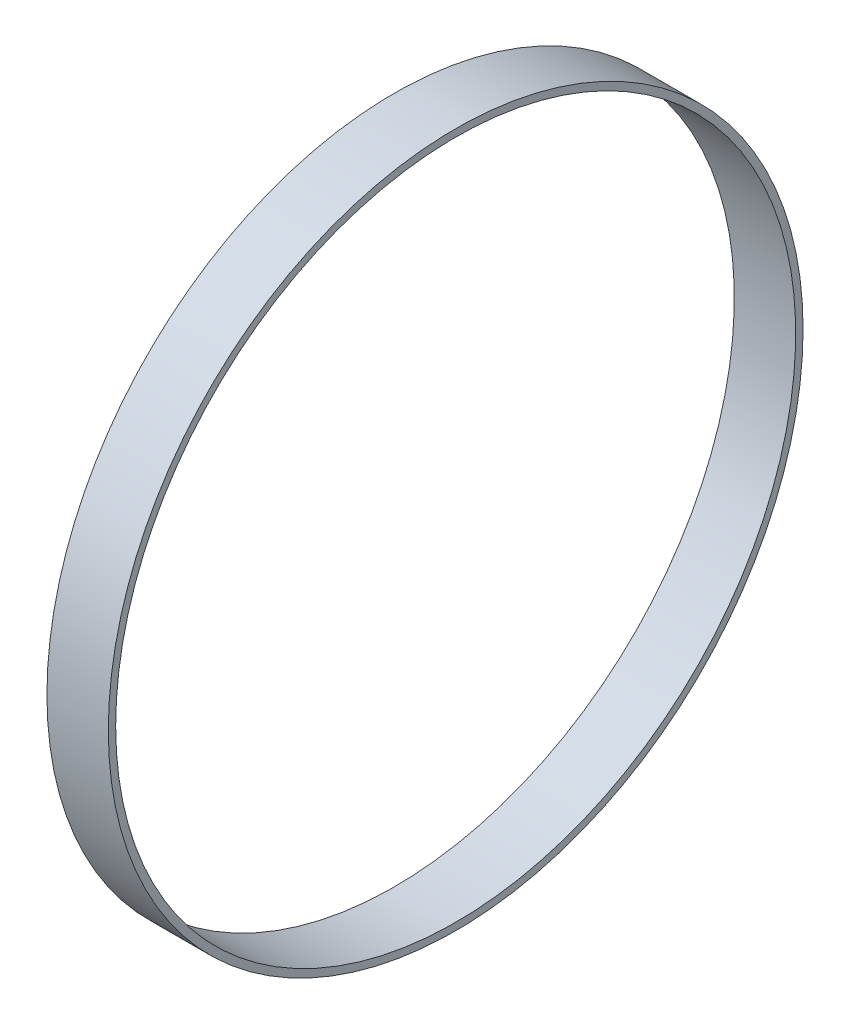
ISO-10303-21;
HEADER;
FILE_DESCRIPTION(('STEP AP214'),'2;1');
FILE_NAME('part.step','',(''),(''),'','','');
FILE_SCHEMA(('AUTOMOTIVE_DESIGN { 1 0 10303 214 1 1 1 1 }'));
ENDSEC;
DATA;
#1=APPLICATION_CONTEXT('core data for automotive mechanical design processes');
#2=APPLICATION_PROTOCOL_DEFINITION('international standard','automotive_design',2000,#1);
#3=PRODUCT_CONTEXT('',#1,'mechanical');
#4=PRODUCT('Part','Part','',(#3));
#5=PRODUCT_RELATED_PRODUCT_CATEGORY('part','',(#4));
#6=PRODUCT_DEFINITION_FORMATION('','',#4);
#7=PRODUCT_DEFINITION_CONTEXT('part definition',#1,'design');
#8=PRODUCT_DEFINITION('design','',#6,#7);
#9=PRODUCT_DEFINITION_SHAPE('','',#8);
#10=(LENGTH_UNIT() NAMED_UNIT(*) SI_UNIT(.MILLI.,.METRE.));
#11=(NAMED_UNIT(*) PLANE_ANGLE_UNIT() SI_UNIT($,.RADIAN.));
#12=(NAMED_UNIT(*) SI_UNIT($,.STERADIAN.) SOLID_ANGLE_UNIT());
#13=UNCERTAINTY_MEASURE_WITH_UNIT(LENGTH_MEASURE(1.E-05),#10,'distance_accuracy_value','');
#14=(GEOMETRIC_REPRESENTATION_CONTEXT(3) GLOBAL_UNCERTAINTY_ASSIGNED_CONTEXT((#13)) GLOBAL_UNIT_ASSIGNED_CONTEXT((#10,
#11,#12)) REPRESENTATION_CONTEXT('',''));
#15=CARTESIAN_POINT('',(0.,0.,0.));
#16=DIRECTION('',(0.,0.,1.));
#17=DIRECTION('',(1.,0.,0.));
#18=AXIS2_PLACEMENT_3D('',#15,#16,#17);
#19=CARTESIAN_POINT('',(-2.5,28.3,0.));
#20=DIRECTION('',(1.,0.,0.));
#21=DIRECTION('',(0.,0.,-1.));
#22=AXIS2_PLACEMENT_3D('',#19,#20,#21);
#23=PLANE('',#22);
#24=CARTESIAN_POINT('',(-2.5,0.,0.));
#25=DIRECTION('',(-1.,0.,0.));
#26=DIRECTION('',(0.,0.,1.));
#27=AXIS2_PLACEMENT_3D('',#24,#25,#26);
#28=CIRCLE('',#27,27.7);
#29=CARTESIAN_POINT('',(-2.5,0.,27.7));
#30=VERTEX_POINT('',#29);
#31=EDGE_CURVE('E10',#30,#30,#28,.T.);
#32=ORIENTED_EDGE('',*,*,#31,.F.);
#33=EDGE_LOOP('',(#32));
#34=FACE_BOUND('',#33,.T.);
#35=CARTESIAN_POINT('',(-2.5,0.,0.));
#36=DIRECTION('',(-1.,0.,0.));
#37=DIRECTION('',(0.,0.,1.));
#38=AXIS2_PLACEMENT_3D('',#35,#36,#37);
#39=CIRCLE('',#38,28.3);
#40=CARTESIAN_POINT('',(-2.5,0.,28.3));
#41=VERTEX_POINT('',#40);
#42=EDGE_CURVE('E48',#41,#41,#39,.T.);
#43=ORIENTED_EDGE('',*,*,#42,.T.);
#44=EDGE_LOOP('',(#43));
#45=FACE_BOUND('',#44,.T.);
#46=ADVANCED_FACE('F34',(#34,#45),#23,.F.);
#47=CARTESIAN_POINT('',(0.,0.,0.));
#48=DIRECTION('',(-1.,0.,0.));
#49=DIRECTION('',(0.,0.,1.));
#50=AXIS2_PLACEMENT_3D('',#47,#48,#49);
#51=CYLINDRICAL_SURFACE('',#50,27.7);
#52=CARTESIAN_POINT('',(2.5,0.,0.));
#53=DIRECTION('',(-1.,0.,0.));
#54=DIRECTION('',(0.,0.,1.));
#55=AXIS2_PLACEMENT_3D('',#52,#53,#54);
#56=CIRCLE('',#55,27.7);
#57=CARTESIAN_POINT('',(2.5,0.,27.7));
#58=VERTEX_POINT('',#57);
#59=EDGE_CURVE('E40',#58,#58,#56,.T.);
#60=ORIENTED_EDGE('',*,*,#59,.F.);
#61=EDGE_LOOP('',(#60));
#62=FACE_BOUND('',#61,.T.);
#63=ORIENTED_EDGE('',*,*,#31,.T.);
#64=EDGE_LOOP('',(#63));
#65=FACE_BOUND('',#64,.T.);
#66=ADVANCED_FACE('F63',(#62,#65),#51,.F.);
#67=CARTESIAN_POINT('',(2.5,28.3,0.));
#68=DIRECTION('',(-1.,0.,0.));
#69=DIRECTION('',(0.,0.,1.));
#70=AXIS2_PLACEMENT_3D('',#67,#68,#69);
#71=PLANE('',#70);
#72=CARTESIAN_POINT('',(2.5,0.,0.));
#73=DIRECTION('',(-1.,0.,0.));
#74=DIRECTION('',(0.,0.,1.));
#75=AXIS2_PLACEMENT_3D('',#72,#73,#74);
#76=CIRCLE('',#75,28.3);
#77=CARTESIAN_POINT('',(2.5,0.,28.3));
#78=VERTEX_POINT('',#77);
#79=EDGE_CURVE('E44',#78,#78,#76,.T.);
#80=ORIENTED_EDGE('',*,*,#79,.F.);
#81=EDGE_LOOP('',(#80));
#82=FACE_BOUND('',#81,.T.);
#83=ORIENTED_EDGE('',*,*,#59,.T.);
#84=EDGE_LOOP('',(#83));
#85=FACE_BOUND('',#84,.T.);
#86=ADVANCED_FACE('F58',(#82,#85),#71,.F.);
#87=CARTESIAN_POINT('',(0.,0.,0.));
#88=DIRECTION('',(-1.,0.,0.));
#89=DIRECTION('',(0.,0.,1.));
#90=AXIS2_PLACEMENT_3D('',#87,#88,#89);
#91=CYLINDRICAL_SURFACE('',#90,28.3);
#92=ORIENTED_EDGE('',*,*,#42,.F.);
#93=EDGE_LOOP('',(#92));
#94=FACE_BOUND('',#93,.T.);
#95=ORIENTED_EDGE('',*,*,#79,.T.);
#96=EDGE_LOOP('',(#95));
#97=FACE_BOUND('',#96,.T.);
#98=ADVANCED_FACE('F55',(#94,#97),#91,.T.);
#99=CLOSED_SHELL('',(#46,#66,#86,#98));
#100=MANIFOLD_SOLID_BREP('B2',#99);
#101=ADVANCED_BREP_SHAPE_REPRESENTATION('',(#18,#100),#14);
#102=SHAPE_DEFINITION_REPRESENTATION(#9,#101);
ENDSEC;
END-ISO-10303-21;
